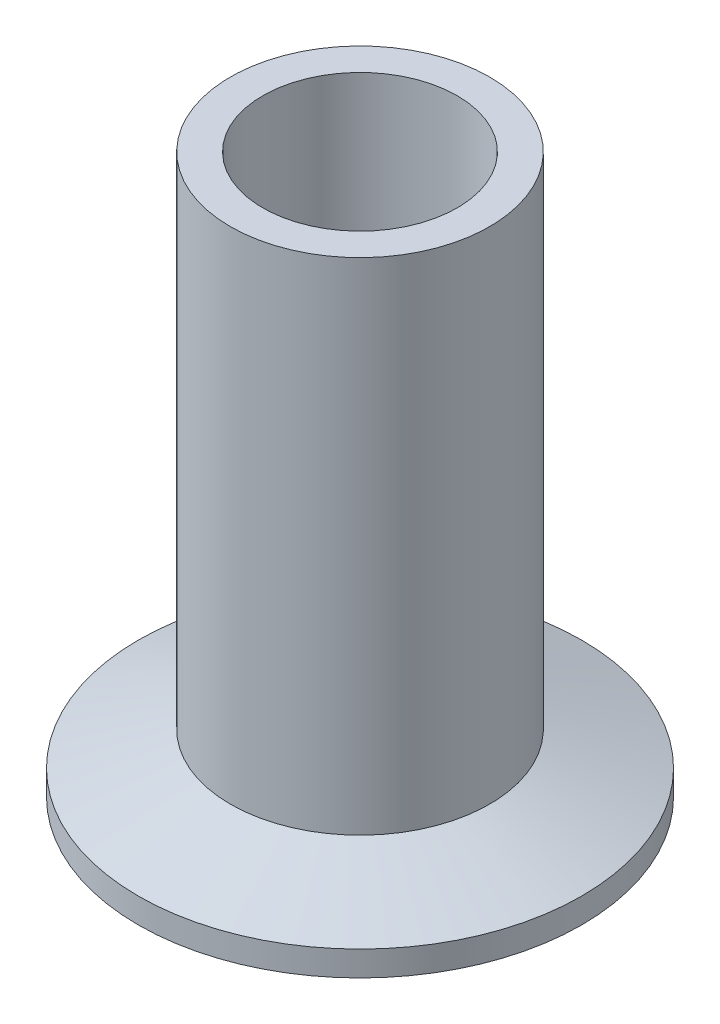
from build123d import *


with BuildPart() as part:
    # Sketch1 → Revolve2 (revolve)
    with BuildSketch(Plane.XY, mode=Mode.PRIVATE) as revolve2_sk:
        with BuildLine():
            Line((-11.049, 0), (-11.049, 63.5))
            Line((-11.049, 63.5), (-14.732, 63.5))
            Line((-14.732, 63.5), (-14.732, 6.653675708))
            Line((-14.732, 6.653675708), (-25.1968, 2.8448))
            Line((-25.1968, 2.8448), (-25.1968, 0))
            Line((-25.1968, 0), (-23.644139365, 0))
            ThreePointArc((-23.644139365, 0), (-23.374940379, 0.077191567), (-23.18755199, 0.285307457))
            Line((-23.18755199, 0.285307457), (-22.9634198, 0.744846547))
            ThreePointArc((-22.9634198, 0.744846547), (-21.855375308, 1.599633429), (-20.696794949, 0.814703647))
            Line((-20.696794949, 0.814703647), (-20.521925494, 0.334253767))
            ThreePointArc((-20.521925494, 0.334253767), (-20.335938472, 0.091870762), (-20.044561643, 0))
            Line((-20.044561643, 0), (-11.049, 0))
        make_face()
    revolve(revolve2_sk.sketch.rotate(Axis((0, 0, 0), (0, 1, 0)), 270), axis=Axis((0, 0, 0), (0, 1, 0)))


solid = part.part
